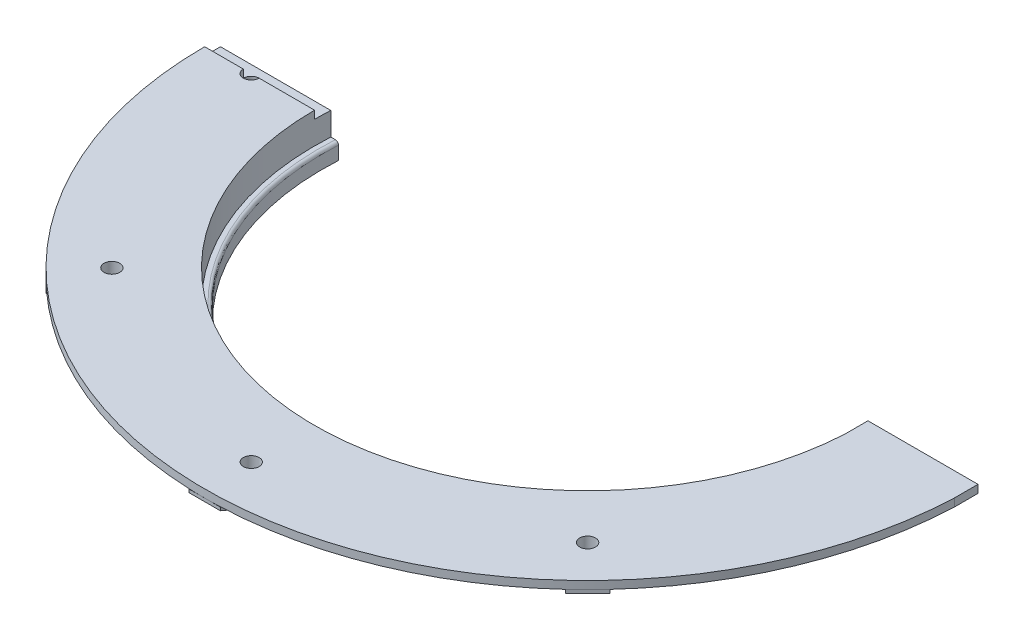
from build123d import *

# Parameters (mm, degrees)
BOSS_EXTRUDE5_DEPTH     = 6.35
F_1_4_20_TAPPED_HOLE1_D = 6.35
CIRPATTERN1_COUNT       = 8
CUT_EXTRUDE1_DEPTH      = 219.602842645
SKETCH22_W              = 47.483933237
SKETCH22_H              = 6.35
CUT_EXTRUDE2_DEPTH      = 3.175
SKETCH23_W              = 44.248802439
SKETCH23_H              = 9.44519534
BOSS_EXTRUDE6_DEPTH     = 3.175


with BuildPart() as part:
    # Sketch1 → Revolve1 (revolve)
    with BuildSketch(Plane.XY, mode=Mode.PRIVATE) as revolve1_sk:
        with BuildLine():
            Line((-118.9355, 6.096), (-106.6927, 6.096))
            Line((-106.6927, 6.096), (-106.6927, 11.43))
            ThreePointArc((-106.6927, 11.43), (-107.064674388, 12.328025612), (-107.9627, 12.7))
            Line((-107.9627, 12.7), (-109.7915, 12.7))
            Line((-109.7915, 12.7), (-109.7915, 25.146))
            Line((-109.7915, 25.146), (-118.9355, 25.146))
            Line((-118.9355, 25.146), (-153.9875, 25.146))
            Line((-153.9875, 25.146), (-153.9875, 21.971))
            Line((-153.9875, 21.971), (-118.9355, 21.971))
            Line((-118.9355, 21.971), (-118.9355, 6.096))
        make_face()
    revolve(revolve1_sk.sketch.rotate(Axis((0, 0, 0), (0, 1, 0)), 270), axis=Axis((0, 0, 0), (0, 1, 0)))

    # Sketch19 → Boss-Extrude5 (add, symmetric)
    with BuildSketch(Plane.XY):
        Polygon((-153.9875, 21.971), (-117.6655, 21.971), (-117.6655, 6.096), (-118.9355, 6.096), (-153.9875, 20.701), align=None)
    boss_extrude5 = extrude(amount=BOSS_EXTRUDE5_DEPTH, both=True)

    # 1_4-20 Tapped Hole1 (through all)
    with Locations(Plane(origin=(0, 25.146, 0), x_dir=(-1, 0, 0), z_dir=(0, 1, 0))):
        with Locations((-135.255, 0)):
            f_1_4_20_tapped_hole1 = Hole(F_1_4_20_TAPPED_HOLE1_D / 2)

    # CirPattern1: Boss-Extrude5, 1_4-20 Tapped Hole1 ×8 about axis
    cirpattern1_axis = Axis((0, 0, 0), (0, 1, 0))
    add([boss_extrude5.rotate(cirpattern1_axis, i * 360 / CIRPATTERN1_COUNT) for i in range(1, CIRPATTERN1_COUNT)])
    add([f_1_4_20_tapped_hole1.rotate(cirpattern1_axis, i * 360 / CIRPATTERN1_COUNT) for i in range(1, CIRPATTERN1_COUNT)], mode=Mode.SUBTRACT)

    # Sketch21 → Cut-Extrude1 (cut, through all)
    with BuildSketch(Plane.XZ.offset(-6.096)):
        Polygon((-153.856516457, -6.35), (-68.51791794, -6.35), (-68.51791794, 6.35), (153.9875, 6.35), (153.9875, -156.605625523), (-153.856516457, -156.605625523), align=None)
    extrude(amount=-CUT_EXTRUDE1_DEPTH, mode=Mode.SUBTRACT)

    # Sketch22 → Cut-Extrude2 (cut)
    with BuildSketch(Plane(origin=(0, 25.146, 0), x_dir=(1, 0, 0), z_dir=(0, 1, 0))):
        with Locations((-130.245533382, 3.175)):
            Rectangle(SKETCH22_W, SKETCH22_H)
    extrude(amount=-CUT_EXTRUDE2_DEPTH, mode=Mode.SUBTRACT)

    # Sketch23 → Boss-Extrude6 (add)
    with BuildSketch(Plane(origin=(0, 25.146, 0), x_dir=(1, 0, 0), z_dir=(0, 1, 0))):
        with Locations((131.732115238, -1.62740233)):
            Rectangle(SKETCH23_W, SKETCH23_H)
    extrude(amount=-BOSS_EXTRUDE6_DEPTH)


solid = part.part
